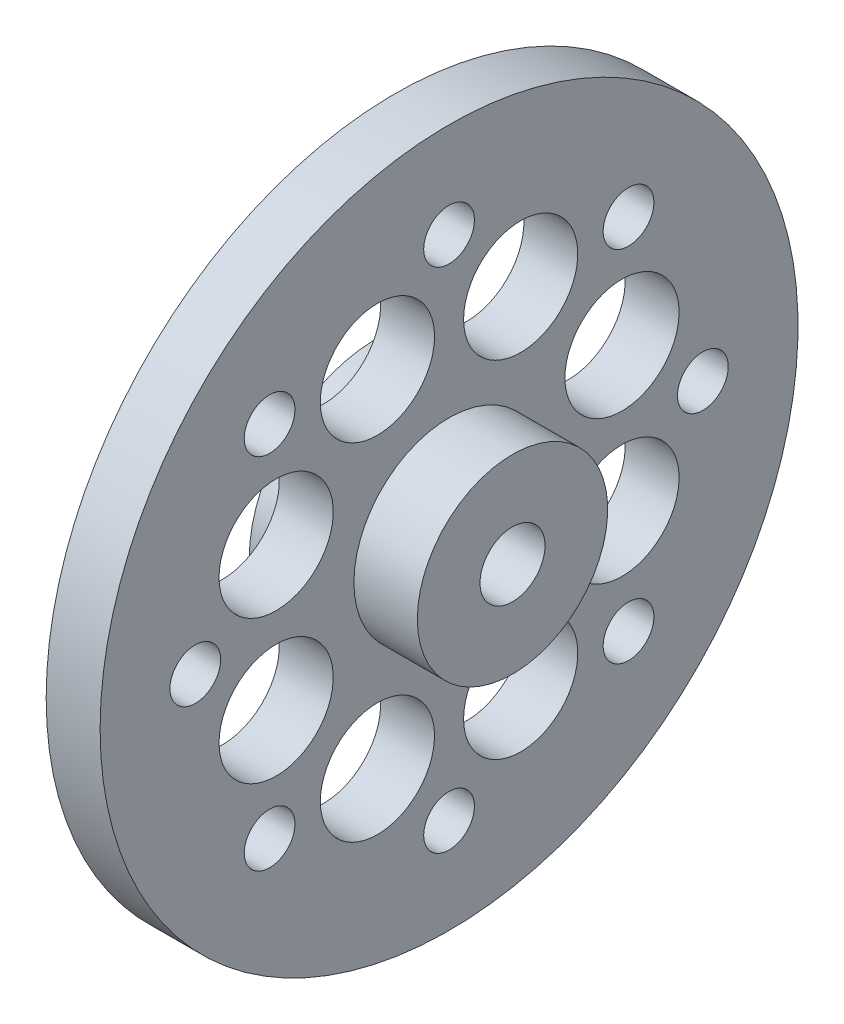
ISO-10303-21;
HEADER;
FILE_DESCRIPTION(('STEP AP214'),'2;1');
FILE_NAME('part.step','',(''),(''),'','','');
FILE_SCHEMA(('AUTOMOTIVE_DESIGN { 1 0 10303 214 1 1 1 1 }'));
ENDSEC;
DATA;
#1=APPLICATION_CONTEXT('core data for automotive mechanical design processes');
#2=APPLICATION_PROTOCOL_DEFINITION('international standard','automotive_design',2000,#1);
#3=PRODUCT_CONTEXT('',#1,'mechanical');
#4=PRODUCT('Part','Part','',(#3));
#5=PRODUCT_RELATED_PRODUCT_CATEGORY('part','',(#4));
#6=PRODUCT_DEFINITION_FORMATION('','',#4);
#7=PRODUCT_DEFINITION_CONTEXT('part definition',#1,'design');
#8=PRODUCT_DEFINITION('design','',#6,#7);
#9=PRODUCT_DEFINITION_SHAPE('','',#8);
#10=(LENGTH_UNIT() NAMED_UNIT(*) SI_UNIT(.MILLI.,.METRE.));
#11=(NAMED_UNIT(*) PLANE_ANGLE_UNIT() SI_UNIT($,.RADIAN.));
#12=(NAMED_UNIT(*) SI_UNIT($,.STERADIAN.) SOLID_ANGLE_UNIT());
#13=UNCERTAINTY_MEASURE_WITH_UNIT(LENGTH_MEASURE(1.E-05),#10,'distance_accuracy_value','');
#14=(GEOMETRIC_REPRESENTATION_CONTEXT(3) GLOBAL_UNCERTAINTY_ASSIGNED_CONTEXT((#13)) GLOBAL_UNIT_ASSIGNED_CONTEXT((#10,
#11,#12)) REPRESENTATION_CONTEXT('',''));
#15=CARTESIAN_POINT('',(0.,0.,0.));
#16=DIRECTION('',(0.,0.,1.));
#17=DIRECTION('',(1.,0.,0.));
#18=AXIS2_PLACEMENT_3D('',#15,#16,#17);
#19=CARTESIAN_POINT('',(-0.6,4.,0.));
#20=DIRECTION('',(1.,0.,0.));
#21=DIRECTION('',(0.,0.,-1.));
#22=AXIS2_PLACEMENT_3D('',#19,#20,#21);
#23=PLANE('',#22);
#24=CARTESIAN_POINT('',(-0.6,0.,0.));
#25=DIRECTION('',(-1.,0.,0.));
#26=DIRECTION('',(0.,0.,1.));
#27=AXIS2_PLACEMENT_3D('',#24,#25,#26);
#28=CIRCLE('',#27,4.);
#29=CARTESIAN_POINT('',(-0.6,0.,4.));
#30=VERTEX_POINT('',#29);
#31=EDGE_CURVE('E19',#30,#30,#28,.F.);
#32=ORIENTED_EDGE('',*,*,#31,.F.);
#33=EDGE_LOOP('',(#32));
#34=FACE_BOUND('',#33,.T.);
#35=CARTESIAN_POINT('',(-0.6,0.,0.));
#36=DIRECTION('',(1.,0.,0.));
#37=DIRECTION('',(0.,0.,-1.));
#38=AXIS2_PLACEMENT_3D('',#35,#36,#37);
#39=CIRCLE('',#38,1.02499999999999);
#40=CARTESIAN_POINT('',(-0.6,0.,-1.02499999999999));
#41=VERTEX_POINT('',#40);
#42=EDGE_CURVE('E137',#41,#41,#39,.T.);
#43=ORIENTED_EDGE('',*,*,#42,.T.);
#44=EDGE_LOOP('',(#43));
#45=FACE_BOUND('',#44,.T.);
#46=ADVANCED_FACE('F15',(#34,#45),#23,.F.);
#47=CARTESIAN_POINT('',(-0.599999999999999,0.,0.));
#48=DIRECTION('',(-1.,0.,0.));
#49=DIRECTION('',(0.,0.,1.));
#50=AXIS2_PLACEMENT_3D('',#47,#48,#49);
#51=CYLINDRICAL_SURFACE('',#50,4.);
#52=ORIENTED_EDGE('',*,*,#31,.T.);
#53=EDGE_LOOP('',(#52));
#54=FACE_BOUND('',#53,.T.);
#55=CARTESIAN_POINT('',(0.,0.,0.));
#56=DIRECTION('',(-1.,0.,0.));
#57=DIRECTION('',(0.,0.,1.));
#58=AXIS2_PLACEMENT_3D('',#55,#56,#57);
#59=CIRCLE('',#58,4.);
#60=CARTESIAN_POINT('',(0.,0.,4.));
#61=VERTEX_POINT('',#60);
#62=EDGE_CURVE('E135',#61,#61,#59,.T.);
#63=ORIENTED_EDGE('',*,*,#62,.T.);
#64=EDGE_LOOP('',(#63));
#65=FACE_BOUND('',#64,.T.);
#66=ADVANCED_FACE('F144',(#54,#65),#51,.T.);
#67=CARTESIAN_POINT('',(3.69999999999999,0.,0.));
#68=DIRECTION('',(1.,0.,0.));
#69=DIRECTION('',(0.,0.,-1.));
#70=AXIS2_PLACEMENT_3D('',#67,#68,#69);
#71=CYLINDRICAL_SURFACE('',#70,1.02499999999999);
#72=ORIENTED_EDGE('',*,*,#42,.F.);
#73=EDGE_LOOP('',(#72));
#74=FACE_BOUND('',#73,.T.);
#75=CARTESIAN_POINT('',(3.7,0.,0.));
#76=DIRECTION('',(1.,0.,0.));
#77=DIRECTION('',(0.,0.,-1.));
#78=AXIS2_PLACEMENT_3D('',#75,#76,#77);
#79=CIRCLE('',#78,1.02499999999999);
#80=CARTESIAN_POINT('',(3.7,0.,-1.02499999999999));
#81=VERTEX_POINT('',#80);
#82=EDGE_CURVE('E132',#81,#81,#79,.T.);
#83=ORIENTED_EDGE('',*,*,#82,.T.);
#84=EDGE_LOOP('',(#83));
#85=FACE_BOUND('',#84,.T.);
#86=ADVANCED_FACE('F154',(#74,#85),#71,.F.);
#87=CARTESIAN_POINT('',(0.,4.,0.));
#88=DIRECTION('',(1.,0.,0.));
#89=DIRECTION('',(0.,0.,-1.));
#90=AXIS2_PLACEMENT_3D('',#87,#88,#89);
#91=PLANE('',#90);
#92=CARTESIAN_POINT('',(0.,5.65685424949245,-5.65685424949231));
#93=DIRECTION('',(-1.,0.,0.));
#94=DIRECTION('',(0.,0.,1.));
#95=AXIS2_PLACEMENT_3D('',#92,#93,#94);
#96=CIRCLE('',#95,0.799999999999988);
#97=CARTESIAN_POINT('',(0.,5.65685424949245,-4.85685424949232));
#98=VERTEX_POINT('',#97);
#99=EDGE_CURVE('E105',#98,#98,#96,.F.);
#100=ORIENTED_EDGE('',*,*,#99,.T.);
#101=EDGE_LOOP('',(#100));
#102=FACE_BOUND('',#101,.T.);
#103=CARTESIAN_POINT('',(0.,0.,-8.));
#104=DIRECTION('',(-1.,0.,0.));
#105=DIRECTION('',(0.,0.,1.));
#106=AXIS2_PLACEMENT_3D('',#103,#104,#105);
#107=CIRCLE('',#106,0.799999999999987);
#108=CARTESIAN_POINT('',(0.,0.,-7.20000000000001));
#109=VERTEX_POINT('',#108);
#110=EDGE_CURVE('E102',#109,#109,#107,.F.);
#111=ORIENTED_EDGE('',*,*,#110,.T.);
#112=EDGE_LOOP('',(#111));
#113=FACE_BOUND('',#112,.T.);
#114=CARTESIAN_POINT('',(0.,8.,0.));
#115=DIRECTION('',(-1.,0.,0.));
#116=DIRECTION('',(0.,0.,1.));
#117=AXIS2_PLACEMENT_3D('',#114,#115,#116);
#118=CIRCLE('',#117,0.799999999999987);
#119=CARTESIAN_POINT('',(0.,8.,0.799999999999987));
#120=VERTEX_POINT('',#119);
#121=EDGE_CURVE('E84',#120,#120,#118,.F.);
#122=ORIENTED_EDGE('',*,*,#121,.T.);
#123=EDGE_LOOP('',(#122));
#124=FACE_BOUND('',#123,.T.);
#125=ORIENTED_EDGE('',*,*,#62,.F.);
#126=EDGE_LOOP('',(#125));
#127=FACE_BOUND('',#126,.T.);
#128=CARTESIAN_POINT('',(0.,0.,0.));
#129=DIRECTION('',(-1.,0.,0.));
#130=DIRECTION('',(0.,0.,1.));
#131=AXIS2_PLACEMENT_3D('',#128,#129,#130);
#132=CIRCLE('',#131,11.);
#133=CARTESIAN_POINT('',(0.,0.,11.));
#134=VERTEX_POINT('',#133);
#135=EDGE_CURVE('E81',#134,#134,#132,.F.);
#136=ORIENTED_EDGE('',*,*,#135,.F.);
#137=EDGE_LOOP('',(#136));
#138=FACE_BOUND('',#137,.T.);
#139=CARTESIAN_POINT('',(0.,5.65685424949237,5.65685424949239));
#140=DIRECTION('',(-1.,0.,0.));
#141=DIRECTION('',(0.,0.,1.));
#142=AXIS2_PLACEMENT_3D('',#139,#140,#141);
#143=CIRCLE('',#142,0.799999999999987);
#144=CARTESIAN_POINT('',(0.,5.65685424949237,6.45685424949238));
#145=VERTEX_POINT('',#144);
#146=EDGE_CURVE('E87',#145,#145,#143,.F.);
#147=ORIENTED_EDGE('',*,*,#146,.T.);
#148=EDGE_LOOP('',(#147));
#149=FACE_BOUND('',#148,.T.);
#150=CARTESIAN_POINT('',(0.,0.,8.));
#151=DIRECTION('',(-1.,0.,0.));
#152=DIRECTION('',(0.,0.,1.));
#153=AXIS2_PLACEMENT_3D('',#150,#151,#152);
#154=CIRCLE('',#153,0.799999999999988);
#155=CARTESIAN_POINT('',(0.,0.,8.79999999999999));
#156=VERTEX_POINT('',#155);
#157=EDGE_CURVE('E90',#156,#156,#154,.F.);
#158=ORIENTED_EDGE('',*,*,#157,.T.);
#159=EDGE_LOOP('',(#158));
#160=FACE_BOUND('',#159,.T.);
#161=CARTESIAN_POINT('',(0.,-5.65685424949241,5.65685424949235));
#162=DIRECTION('',(-1.,0.,0.));
#163=DIRECTION('',(0.,0.,1.));
#164=AXIS2_PLACEMENT_3D('',#161,#162,#163);
#165=CIRCLE('',#164,0.799999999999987);
#166=CARTESIAN_POINT('',(0.,-5.65685424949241,6.45685424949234));
#167=VERTEX_POINT('',#166);
#168=EDGE_CURVE('E93',#167,#167,#165,.F.);
#169=ORIENTED_EDGE('',*,*,#168,.T.);
#170=EDGE_LOOP('',(#169));
#171=FACE_BOUND('',#170,.T.);
#172=CARTESIAN_POINT('',(0.,-8.,0.));
#173=DIRECTION('',(-1.,0.,0.));
#174=DIRECTION('',(0.,0.,1.));
#175=AXIS2_PLACEMENT_3D('',#172,#173,#174);
#176=CIRCLE('',#175,0.799999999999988);
#177=CARTESIAN_POINT('',(0.,-8.,0.799999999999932));
#178=VERTEX_POINT('',#177);
#179=EDGE_CURVE('E96',#178,#178,#176,.F.);
#180=ORIENTED_EDGE('',*,*,#179,.T.);
#181=EDGE_LOOP('',(#180));
#182=FACE_BOUND('',#181,.T.);
#183=CARTESIAN_POINT('',(0.,-5.65685424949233,-5.65685424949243));
#184=DIRECTION('',(-1.,0.,0.));
#185=DIRECTION('',(0.,0.,1.));
#186=AXIS2_PLACEMENT_3D('',#183,#184,#185);
#187=CIRCLE('',#186,0.799999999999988);
#188=CARTESIAN_POINT('',(0.,-5.65685424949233,-4.85685424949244));
#189=VERTEX_POINT('',#188);
#190=EDGE_CURVE('E99',#189,#189,#187,.F.);
#191=ORIENTED_EDGE('',*,*,#190,.T.);
#192=EDGE_LOOP('',(#191));
#193=FACE_BOUND('',#192,.T.);
#194=CARTESIAN_POINT('',(0.,5.45088924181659,-2.25783225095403));
#195=DIRECTION('',(-1.,0.,0.));
#196=DIRECTION('',(0.,0.,1.));
#197=AXIS2_PLACEMENT_3D('',#194,#195,#196);
#198=CIRCLE('',#197,1.8);
#199=CARTESIAN_POINT('',(0.,5.45088924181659,-0.457832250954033));
#200=VERTEX_POINT('',#199);
#201=EDGE_CURVE('E108',#200,#200,#198,.F.);
#202=ORIENTED_EDGE('',*,*,#201,.T.);
#203=EDGE_LOOP('',(#202));
#204=FACE_BOUND('',#203,.T.);
#205=CARTESIAN_POINT('',(0.,5.45088924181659,2.25783225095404));
#206=DIRECTION('',(-1.,0.,0.));
#207=DIRECTION('',(0.,0.,1.));
#208=AXIS2_PLACEMENT_3D('',#205,#206,#207);
#209=CIRCLE('',#208,1.8);
#210=CARTESIAN_POINT('',(0.,5.45088924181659,4.05783225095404));
#211=VERTEX_POINT('',#210);
#212=EDGE_CURVE('E111',#211,#211,#209,.F.);
#213=ORIENTED_EDGE('',*,*,#212,.T.);
#214=EDGE_LOOP('',(#213));
#215=FACE_BOUND('',#214,.T.);
#216=CARTESIAN_POINT('',(0.,2.25783225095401,5.4508892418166));
#217=DIRECTION('',(-1.,0.,0.));
#218=DIRECTION('',(0.,0.,1.));
#219=AXIS2_PLACEMENT_3D('',#216,#217,#218);
#220=CIRCLE('',#219,1.8);
#221=CARTESIAN_POINT('',(0.,2.25783225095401,7.2508892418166));
#222=VERTEX_POINT('',#221);
#223=EDGE_CURVE('E114',#222,#222,#220,.F.);
#224=ORIENTED_EDGE('',*,*,#223,.T.);
#225=EDGE_LOOP('',(#224));
#226=FACE_BOUND('',#225,.T.);
#227=CARTESIAN_POINT('',(0.,-2.25783225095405,5.45088924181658));
#228=DIRECTION('',(-1.,0.,0.));
#229=DIRECTION('',(0.,0.,1.));
#230=AXIS2_PLACEMENT_3D('',#227,#228,#229);
#231=CIRCLE('',#230,1.8);
#232=CARTESIAN_POINT('',(0.,-2.25783225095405,7.25088924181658));
#233=VERTEX_POINT('',#232);
#234=EDGE_CURVE('E117',#233,#233,#231,.F.);
#235=ORIENTED_EDGE('',*,*,#234,.T.);
#236=EDGE_LOOP('',(#235));
#237=FACE_BOUND('',#236,.T.);
#238=CARTESIAN_POINT('',(0.,-5.45088924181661,2.257832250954));
#239=DIRECTION('',(-1.,0.,0.));
#240=DIRECTION('',(0.,0.,1.));
#241=AXIS2_PLACEMENT_3D('',#238,#239,#240);
#242=CIRCLE('',#241,1.8);
#243=CARTESIAN_POINT('',(0.,-5.45088924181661,4.057832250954));
#244=VERTEX_POINT('',#243);
#245=EDGE_CURVE('E120',#244,#244,#242,.F.);
#246=ORIENTED_EDGE('',*,*,#245,.T.);
#247=EDGE_LOOP('',(#246));
#248=FACE_BOUND('',#247,.T.);
#249=CARTESIAN_POINT('',(0.,-5.45088924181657,-2.25783225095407));
#250=DIRECTION('',(-1.,0.,0.));
#251=DIRECTION('',(0.,0.,1.));
#252=AXIS2_PLACEMENT_3D('',#249,#250,#251);
#253=CIRCLE('',#252,1.8);
#254=CARTESIAN_POINT('',(0.,-5.45088924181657,-0.457832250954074));
#255=VERTEX_POINT('',#254);
#256=EDGE_CURVE('E123',#255,#255,#253,.F.);
#257=ORIENTED_EDGE('',*,*,#256,.T.);
#258=EDGE_LOOP('',(#257));
#259=FACE_BOUND('',#258,.T.);
#260=CARTESIAN_POINT('',(0.,-2.25783225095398,-5.45088924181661));
#261=DIRECTION('',(-1.,0.,0.));
#262=DIRECTION('',(0.,0.,1.));
#263=AXIS2_PLACEMENT_3D('',#260,#261,#262);
#264=CIRCLE('',#263,1.8);
#265=CARTESIAN_POINT('',(0.,-2.25783225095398,-3.65088924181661));
#266=VERTEX_POINT('',#265);
#267=EDGE_CURVE('E126',#266,#266,#264,.F.);
#268=ORIENTED_EDGE('',*,*,#267,.T.);
#269=EDGE_LOOP('',(#268));
#270=FACE_BOUND('',#269,.T.);
#271=CARTESIAN_POINT('',(0.,2.25783225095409,-5.45088924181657));
#272=DIRECTION('',(-1.,0.,0.));
#273=DIRECTION('',(0.,0.,1.));
#274=AXIS2_PLACEMENT_3D('',#271,#272,#273);
#275=CIRCLE('',#274,1.8);
#276=CARTESIAN_POINT('',(0.,2.25783225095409,-3.65088924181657));
#277=VERTEX_POINT('',#276);
#278=EDGE_CURVE('E129',#277,#277,#275,.F.);
#279=ORIENTED_EDGE('',*,*,#278,.T.);
#280=EDGE_LOOP('',(#279));
#281=FACE_BOUND('',#280,.T.);
#282=ADVANCED_FACE('F207',(#102,#113,#124,#127,#138,#149,#160,#171,#182,#193,#204,#215,#226,
#237,#248,#259,#270,#281),#91,.F.);
#283=CARTESIAN_POINT('',(3.7,3.,0.));
#284=DIRECTION('',(-1.,0.,0.));
#285=DIRECTION('',(0.,0.,1.));
#286=AXIS2_PLACEMENT_3D('',#283,#284,#285);
#287=PLANE('',#286);
#288=CARTESIAN_POINT('',(3.7,0.,0.));
#289=DIRECTION('',(-1.,0.,0.));
#290=DIRECTION('',(0.,0.,1.));
#291=AXIS2_PLACEMENT_3D('',#288,#289,#290);
#292=CIRCLE('',#291,3.);
#293=CARTESIAN_POINT('',(3.7,0.,3.));
#294=VERTEX_POINT('',#293);
#295=EDGE_CURVE('E78',#294,#294,#292,.T.);
#296=ORIENTED_EDGE('',*,*,#295,.F.);
#297=EDGE_LOOP('',(#296));
#298=FACE_BOUND('',#297,.T.);
#299=ORIENTED_EDGE('',*,*,#82,.F.);
#300=EDGE_LOOP('',(#299));
#301=FACE_BOUND('',#300,.T.);
#302=ADVANCED_FACE('F203',(#298,#301),#287,.F.);
#303=CARTESIAN_POINT('',(3.7,2.25783225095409,-5.45088924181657));
#304=DIRECTION('',(-1.,0.,0.));
#305=DIRECTION('',(0.,0.,1.));
#306=AXIS2_PLACEMENT_3D('',#303,#304,#305);
#307=CYLINDRICAL_SURFACE('',#306,1.8);
#308=CARTESIAN_POINT('',(1.7,2.25783225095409,-5.45088924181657));
#309=DIRECTION('',(-1.,0.,0.));
#310=DIRECTION('',(0.,0.,1.));
#311=AXIS2_PLACEMENT_3D('',#308,#309,#310);
#312=CIRCLE('',#311,1.8);
#313=CARTESIAN_POINT('',(1.7,2.25783225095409,-3.65088924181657));
#314=VERTEX_POINT('',#313);
#315=EDGE_CURVE('E75',#314,#314,#312,.F.);
#316=ORIENTED_EDGE('',*,*,#315,.T.);
#317=EDGE_LOOP('',(#316));
#318=FACE_BOUND('',#317,.T.);
#319=ORIENTED_EDGE('',*,*,#278,.F.);
#320=EDGE_LOOP('',(#319));
#321=FACE_BOUND('',#320,.T.);
#322=ADVANCED_FACE('F199',(#318,#321),#307,.F.);
#323=CARTESIAN_POINT('',(3.7,-2.25783225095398,-5.45088924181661));
#324=DIRECTION('',(-1.,0.,0.));
#325=DIRECTION('',(0.,0.,1.));
#326=AXIS2_PLACEMENT_3D('',#323,#324,#325);
#327=CYLINDRICAL_SURFACE('',#326,1.8);
#328=CARTESIAN_POINT('',(1.7,-2.25783225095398,-5.45088924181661));
#329=DIRECTION('',(-1.,0.,0.));
#330=DIRECTION('',(0.,0.,1.));
#331=AXIS2_PLACEMENT_3D('',#328,#329,#330);
#332=CIRCLE('',#331,1.8);
#333=CARTESIAN_POINT('',(1.7,-2.25783225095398,-3.65088924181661));
#334=VERTEX_POINT('',#333);
#335=EDGE_CURVE('E72',#334,#334,#332,.F.);
#336=ORIENTED_EDGE('',*,*,#335,.T.);
#337=EDGE_LOOP('',(#336));
#338=FACE_BOUND('',#337,.T.);
#339=ORIENTED_EDGE('',*,*,#267,.F.);
#340=EDGE_LOOP('',(#339));
#341=FACE_BOUND('',#340,.T.);
#342=ADVANCED_FACE('F202',(#338,#341),#327,.F.);
#343=CARTESIAN_POINT('',(3.7,-5.45088924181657,-2.25783225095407));
#344=DIRECTION('',(-1.,0.,0.));
#345=DIRECTION('',(0.,0.,1.));
#346=AXIS2_PLACEMENT_3D('',#343,#344,#345);
#347=CYLINDRICAL_SURFACE('',#346,1.8);
#348=CARTESIAN_POINT('',(1.7,-5.45088924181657,-2.25783225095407));
#349=DIRECTION('',(-1.,0.,0.));
#350=DIRECTION('',(0.,0.,1.));
#351=AXIS2_PLACEMENT_3D('',#348,#349,#350);
#352=CIRCLE('',#351,1.8);
#353=CARTESIAN_POINT('',(1.7,-5.45088924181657,-0.457832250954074));
#354=VERTEX_POINT('',#353);
#355=EDGE_CURVE('E69',#354,#354,#352,.F.);
#356=ORIENTED_EDGE('',*,*,#355,.T.);
#357=EDGE_LOOP('',(#356));
#358=FACE_BOUND('',#357,.T.);
#359=ORIENTED_EDGE('',*,*,#256,.F.);
#360=EDGE_LOOP('',(#359));
#361=FACE_BOUND('',#360,.T.);
#362=ADVANCED_FACE('F224',(#358,#361),#347,.F.);
#363=CARTESIAN_POINT('',(3.7,-5.45088924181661,2.257832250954));
#364=DIRECTION('',(-1.,0.,0.));
#365=DIRECTION('',(0.,0.,1.));
#366=AXIS2_PLACEMENT_3D('',#363,#364,#365);
#367=CYLINDRICAL_SURFACE('',#366,1.8);
#368=CARTESIAN_POINT('',(1.7,-5.45088924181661,2.257832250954));
#369=DIRECTION('',(-1.,0.,0.));
#370=DIRECTION('',(0.,0.,1.));
#371=AXIS2_PLACEMENT_3D('',#368,#369,#370);
#372=CIRCLE('',#371,1.8);
#373=CARTESIAN_POINT('',(1.7,-5.45088924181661,4.057832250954));
#374=VERTEX_POINT('',#373);
#375=EDGE_CURVE('E66',#374,#374,#372,.F.);
#376=ORIENTED_EDGE('',*,*,#375,.T.);
#377=EDGE_LOOP('',(#376));
#378=FACE_BOUND('',#377,.T.);
#379=ORIENTED_EDGE('',*,*,#245,.F.);
#380=EDGE_LOOP('',(#379));
#381=FACE_BOUND('',#380,.T.);
#382=ADVANCED_FACE('F228',(#378,#381),#367,.F.);
#383=CARTESIAN_POINT('',(3.7,-2.25783225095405,5.45088924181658));
#384=DIRECTION('',(-1.,0.,0.));
#385=DIRECTION('',(0.,0.,1.));
#386=AXIS2_PLACEMENT_3D('',#383,#384,#385);
#387=CYLINDRICAL_SURFACE('',#386,1.8);
#388=CARTESIAN_POINT('',(1.7,-2.25783225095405,5.45088924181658));
#389=DIRECTION('',(-1.,0.,0.));
#390=DIRECTION('',(0.,0.,1.));
#391=AXIS2_PLACEMENT_3D('',#388,#389,#390);
#392=CIRCLE('',#391,1.8);
#393=CARTESIAN_POINT('',(1.7,-2.25783225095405,7.25088924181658));
#394=VERTEX_POINT('',#393);
#395=EDGE_CURVE('E63',#394,#394,#392,.F.);
#396=ORIENTED_EDGE('',*,*,#395,.T.);
#397=EDGE_LOOP('',(#396));
#398=FACE_BOUND('',#397,.T.);
#399=ORIENTED_EDGE('',*,*,#234,.F.);
#400=EDGE_LOOP('',(#399));
#401=FACE_BOUND('',#400,.T.);
#402=ADVANCED_FACE('F232',(#398,#401),#387,.F.);
#403=CARTESIAN_POINT('',(3.7,2.25783225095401,5.4508892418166));
#404=DIRECTION('',(-1.,0.,0.));
#405=DIRECTION('',(0.,0.,1.));
#406=AXIS2_PLACEMENT_3D('',#403,#404,#405);
#407=CYLINDRICAL_SURFACE('',#406,1.8);
#408=CARTESIAN_POINT('',(1.7,2.25783225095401,5.4508892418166));
#409=DIRECTION('',(-1.,0.,0.));
#410=DIRECTION('',(0.,0.,1.));
#411=AXIS2_PLACEMENT_3D('',#408,#409,#410);
#412=CIRCLE('',#411,1.8);
#413=CARTESIAN_POINT('',(1.7,2.25783225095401,7.2508892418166));
#414=VERTEX_POINT('',#413);
#415=EDGE_CURVE('E60',#414,#414,#412,.F.);
#416=ORIENTED_EDGE('',*,*,#415,.T.);
#417=EDGE_LOOP('',(#416));
#418=FACE_BOUND('',#417,.T.);
#419=ORIENTED_EDGE('',*,*,#223,.F.);
#420=EDGE_LOOP('',(#419));
#421=FACE_BOUND('',#420,.T.);
#422=ADVANCED_FACE('F236',(#418,#421),#407,.F.);
#423=CARTESIAN_POINT('',(3.7,5.45088924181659,2.25783225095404));
#424=DIRECTION('',(-1.,0.,0.));
#425=DIRECTION('',(0.,0.,1.));
#426=AXIS2_PLACEMENT_3D('',#423,#424,#425);
#427=CYLINDRICAL_SURFACE('',#426,1.8);
#428=CARTESIAN_POINT('',(1.7,5.45088924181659,2.25783225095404));
#429=DIRECTION('',(-1.,0.,0.));
#430=DIRECTION('',(0.,0.,1.));
#431=AXIS2_PLACEMENT_3D('',#428,#429,#430);
#432=CIRCLE('',#431,1.8);
#433=CARTESIAN_POINT('',(1.7,5.45088924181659,4.05783225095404));
#434=VERTEX_POINT('',#433);
#435=EDGE_CURVE('E57',#434,#434,#432,.F.);
#436=ORIENTED_EDGE('',*,*,#435,.T.);
#437=EDGE_LOOP('',(#436));
#438=FACE_BOUND('',#437,.T.);
#439=ORIENTED_EDGE('',*,*,#212,.F.);
#440=EDGE_LOOP('',(#439));
#441=FACE_BOUND('',#440,.T.);
#442=ADVANCED_FACE('F240',(#438,#441),#427,.F.);
#443=CARTESIAN_POINT('',(3.7,5.45088924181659,-2.25783225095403));
#444=DIRECTION('',(-1.,0.,0.));
#445=DIRECTION('',(0.,0.,1.));
#446=AXIS2_PLACEMENT_3D('',#443,#444,#445);
#447=CYLINDRICAL_SURFACE('',#446,1.8);
#448=CARTESIAN_POINT('',(1.7,5.45088924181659,-2.25783225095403));
#449=DIRECTION('',(-1.,0.,0.));
#450=DIRECTION('',(0.,0.,1.));
#451=AXIS2_PLACEMENT_3D('',#448,#449,#450);
#452=CIRCLE('',#451,1.8);
#453=CARTESIAN_POINT('',(1.7,5.45088924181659,-0.457832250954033));
#454=VERTEX_POINT('',#453);
#455=EDGE_CURVE('E54',#454,#454,#452,.F.);
#456=ORIENTED_EDGE('',*,*,#455,.T.);
#457=EDGE_LOOP('',(#456));
#458=FACE_BOUND('',#457,.T.);
#459=ORIENTED_EDGE('',*,*,#201,.F.);
#460=EDGE_LOOP('',(#459));
#461=FACE_BOUND('',#460,.T.);
#462=ADVANCED_FACE('F244',(#458,#461),#447,.F.);
#463=CARTESIAN_POINT('',(0.,5.65685424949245,-5.65685424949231));
#464=DIRECTION('',(-1.,0.,0.));
#465=DIRECTION('',(0.,0.,1.));
#466=AXIS2_PLACEMENT_3D('',#463,#464,#465);
#467=CYLINDRICAL_SURFACE('',#466,0.799999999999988);
#468=CARTESIAN_POINT('',(1.7,5.65685424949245,-5.65685424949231));
#469=DIRECTION('',(-1.,0.,0.));
#470=DIRECTION('',(0.,0.,1.));
#471=AXIS2_PLACEMENT_3D('',#468,#469,#470);
#472=CIRCLE('',#471,0.799999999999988);
#473=CARTESIAN_POINT('',(1.7,5.65685424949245,-4.85685424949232));
#474=VERTEX_POINT('',#473);
#475=EDGE_CURVE('E51',#474,#474,#472,.F.);
#476=ORIENTED_EDGE('',*,*,#475,.T.);
#477=EDGE_LOOP('',(#476));
#478=FACE_BOUND('',#477,.T.);
#479=ORIENTED_EDGE('',*,*,#99,.F.);
#480=EDGE_LOOP('',(#479));
#481=FACE_BOUND('',#480,.T.);
#482=ADVANCED_FACE('F248',(#478,#481),#467,.F.);
#483=CARTESIAN_POINT('',(0.,0.,-8.));
#484=DIRECTION('',(-1.,0.,0.));
#485=DIRECTION('',(0.,0.,1.));
#486=AXIS2_PLACEMENT_3D('',#483,#484,#485);
#487=CYLINDRICAL_SURFACE('',#486,0.799999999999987);
#488=CARTESIAN_POINT('',(1.7,0.,-8.));
#489=DIRECTION('',(-1.,0.,0.));
#490=DIRECTION('',(0.,0.,1.));
#491=AXIS2_PLACEMENT_3D('',#488,#489,#490);
#492=CIRCLE('',#491,0.799999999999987);
#493=CARTESIAN_POINT('',(1.7,0.,-7.20000000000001));
#494=VERTEX_POINT('',#493);
#495=EDGE_CURVE('E48',#494,#494,#492,.F.);
#496=ORIENTED_EDGE('',*,*,#495,.T.);
#497=EDGE_LOOP('',(#496));
#498=FACE_BOUND('',#497,.T.);
#499=ORIENTED_EDGE('',*,*,#110,.F.);
#500=EDGE_LOOP('',(#499));
#501=FACE_BOUND('',#500,.T.);
#502=ADVANCED_FACE('F252',(#498,#501),#487,.F.);
#503=CARTESIAN_POINT('',(0.,-5.65685424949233,-5.65685424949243));
#504=DIRECTION('',(-1.,0.,0.));
#505=DIRECTION('',(0.,0.,1.));
#506=AXIS2_PLACEMENT_3D('',#503,#504,#505);
#507=CYLINDRICAL_SURFACE('',#506,0.799999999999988);
#508=CARTESIAN_POINT('',(1.7,-5.65685424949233,-5.65685424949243));
#509=DIRECTION('',(-1.,0.,0.));
#510=DIRECTION('',(0.,0.,1.));
#511=AXIS2_PLACEMENT_3D('',#508,#509,#510);
#512=CIRCLE('',#511,0.799999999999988);
#513=CARTESIAN_POINT('',(1.7,-5.65685424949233,-4.85685424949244));
#514=VERTEX_POINT('',#513);
#515=EDGE_CURVE('E45',#514,#514,#512,.F.);
#516=ORIENTED_EDGE('',*,*,#515,.T.);
#517=EDGE_LOOP('',(#516));
#518=FACE_BOUND('',#517,.T.);
#519=ORIENTED_EDGE('',*,*,#190,.F.);
#520=EDGE_LOOP('',(#519));
#521=FACE_BOUND('',#520,.T.);
#522=ADVANCED_FACE('F256',(#518,#521),#507,.F.);
#523=CARTESIAN_POINT('',(0.,-8.,0.));
#524=DIRECTION('',(-1.,0.,0.));
#525=DIRECTION('',(0.,0.,1.));
#526=AXIS2_PLACEMENT_3D('',#523,#524,#525);
#527=CYLINDRICAL_SURFACE('',#526,0.799999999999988);
#528=CARTESIAN_POINT('',(1.7,-8.,0.));
#529=DIRECTION('',(-1.,0.,0.));
#530=DIRECTION('',(0.,0.,1.));
#531=AXIS2_PLACEMENT_3D('',#528,#529,#530);
#532=CIRCLE('',#531,0.799999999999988);
#533=CARTESIAN_POINT('',(1.7,-8.,0.799999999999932));
#534=VERTEX_POINT('',#533);
#535=EDGE_CURVE('E42',#534,#534,#532,.F.);
#536=ORIENTED_EDGE('',*,*,#535,.T.);
#537=EDGE_LOOP('',(#536));
#538=FACE_BOUND('',#537,.T.);
#539=ORIENTED_EDGE('',*,*,#179,.F.);
#540=EDGE_LOOP('',(#539));
#541=FACE_BOUND('',#540,.T.);
#542=ADVANCED_FACE('F260',(#538,#541),#527,.F.);
#543=CARTESIAN_POINT('',(0.,-5.65685424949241,5.65685424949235));
#544=DIRECTION('',(-1.,0.,0.));
#545=DIRECTION('',(0.,0.,1.));
#546=AXIS2_PLACEMENT_3D('',#543,#544,#545);
#547=CYLINDRICAL_SURFACE('',#546,0.799999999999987);
#548=CARTESIAN_POINT('',(1.7,-5.65685424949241,5.65685424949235));
#549=DIRECTION('',(-1.,0.,0.));
#550=DIRECTION('',(0.,0.,1.));
#551=AXIS2_PLACEMENT_3D('',#548,#549,#550);
#552=CIRCLE('',#551,0.799999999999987);
#553=CARTESIAN_POINT('',(1.7,-5.65685424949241,6.45685424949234));
#554=VERTEX_POINT('',#553);
#555=EDGE_CURVE('E39',#554,#554,#552,.F.);
#556=ORIENTED_EDGE('',*,*,#555,.T.);
#557=EDGE_LOOP('',(#556));
#558=FACE_BOUND('',#557,.T.);
#559=ORIENTED_EDGE('',*,*,#168,.F.);
#560=EDGE_LOOP('',(#559));
#561=FACE_BOUND('',#560,.T.);
#562=ADVANCED_FACE('F264',(#558,#561),#547,.F.);
#563=CARTESIAN_POINT('',(0.,0.,8.));
#564=DIRECTION('',(-1.,0.,0.));
#565=DIRECTION('',(0.,0.,1.));
#566=AXIS2_PLACEMENT_3D('',#563,#564,#565);
#567=CYLINDRICAL_SURFACE('',#566,0.799999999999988);
#568=CARTESIAN_POINT('',(1.7,0.,8.));
#569=DIRECTION('',(-1.,0.,0.));
#570=DIRECTION('',(0.,0.,1.));
#571=AXIS2_PLACEMENT_3D('',#568,#569,#570);
#572=CIRCLE('',#571,0.799999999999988);
#573=CARTESIAN_POINT('',(1.7,0.,8.79999999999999));
#574=VERTEX_POINT('',#573);
#575=EDGE_CURVE('E36',#574,#574,#572,.F.);
#576=ORIENTED_EDGE('',*,*,#575,.T.);
#577=EDGE_LOOP('',(#576));
#578=FACE_BOUND('',#577,.T.);
#579=ORIENTED_EDGE('',*,*,#157,.F.);
#580=EDGE_LOOP('',(#579));
#581=FACE_BOUND('',#580,.T.);
#582=ADVANCED_FACE('F268',(#578,#581),#567,.F.);
#583=CARTESIAN_POINT('',(0.,5.65685424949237,5.65685424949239));
#584=DIRECTION('',(-1.,0.,0.));
#585=DIRECTION('',(0.,0.,1.));
#586=AXIS2_PLACEMENT_3D('',#583,#584,#585);
#587=CYLINDRICAL_SURFACE('',#586,0.799999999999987);
#588=CARTESIAN_POINT('',(1.7,5.65685424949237,5.65685424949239));
#589=DIRECTION('',(-1.,0.,0.));
#590=DIRECTION('',(0.,0.,1.));
#591=AXIS2_PLACEMENT_3D('',#588,#589,#590);
#592=CIRCLE('',#591,0.799999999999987);
#593=CARTESIAN_POINT('',(1.7,5.65685424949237,6.45685424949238));
#594=VERTEX_POINT('',#593);
#595=EDGE_CURVE('E33',#594,#594,#592,.F.);
#596=ORIENTED_EDGE('',*,*,#595,.T.);
#597=EDGE_LOOP('',(#596));
#598=FACE_BOUND('',#597,.T.);
#599=ORIENTED_EDGE('',*,*,#146,.F.);
#600=EDGE_LOOP('',(#599));
#601=FACE_BOUND('',#600,.T.);
#602=ADVANCED_FACE('F272',(#598,#601),#587,.F.);
#603=CARTESIAN_POINT('',(0.,8.,0.));
#604=DIRECTION('',(-1.,0.,0.));
#605=DIRECTION('',(0.,0.,1.));
#606=AXIS2_PLACEMENT_3D('',#603,#604,#605);
#607=CYLINDRICAL_SURFACE('',#606,0.799999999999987);
#608=CARTESIAN_POINT('',(1.7,8.,0.));
#609=DIRECTION('',(-1.,0.,0.));
#610=DIRECTION('',(0.,0.,1.));
#611=AXIS2_PLACEMENT_3D('',#608,#609,#610);
#612=CIRCLE('',#611,0.799999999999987);
#613=CARTESIAN_POINT('',(1.7,8.,0.799999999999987));
#614=VERTEX_POINT('',#613);
#615=EDGE_CURVE('E28',#614,#614,#612,.F.);
#616=ORIENTED_EDGE('',*,*,#615,.T.);
#617=EDGE_LOOP('',(#616));
#618=FACE_BOUND('',#617,.T.);
#619=ORIENTED_EDGE('',*,*,#121,.F.);
#620=EDGE_LOOP('',(#619));
#621=FACE_BOUND('',#620,.T.);
#622=ADVANCED_FACE('F276',(#618,#621),#607,.F.);
#623=CARTESIAN_POINT('',(-0.599999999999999,0.,0.));
#624=DIRECTION('',(-1.,0.,0.));
#625=DIRECTION('',(0.,0.,1.));
#626=AXIS2_PLACEMENT_3D('',#623,#624,#625);
#627=CYLINDRICAL_SURFACE('',#626,11.);
#628=ORIENTED_EDGE('',*,*,#135,.T.);
#629=EDGE_LOOP('',(#628));
#630=FACE_BOUND('',#629,.T.);
#631=CARTESIAN_POINT('',(1.7,0.,0.));
#632=DIRECTION('',(-1.,0.,0.));
#633=DIRECTION('',(0.,0.,1.));
#634=AXIS2_PLACEMENT_3D('',#631,#632,#633);
#635=CIRCLE('',#634,11.);
#636=CARTESIAN_POINT('',(1.7,0.,11.));
#637=VERTEX_POINT('',#636);
#638=EDGE_CURVE('E23',#637,#637,#635,.T.);
#639=ORIENTED_EDGE('',*,*,#638,.T.);
#640=EDGE_LOOP('',(#639));
#641=FACE_BOUND('',#640,.T.);
#642=ADVANCED_FACE('F163',(#630,#641),#627,.T.);
#643=CARTESIAN_POINT('',(-0.599999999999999,0.,0.));
#644=DIRECTION('',(-1.,0.,0.));
#645=DIRECTION('',(0.,0.,1.));
#646=AXIS2_PLACEMENT_3D('',#643,#644,#645);
#647=CYLINDRICAL_SURFACE('',#646,3.);
#648=CARTESIAN_POINT('',(1.7,0.,0.));
#649=DIRECTION('',(-1.,0.,0.));
#650=DIRECTION('',(0.,0.,1.));
#651=AXIS2_PLACEMENT_3D('',#648,#649,#650);
#652=CIRCLE('',#651,3.);
#653=CARTESIAN_POINT('',(1.7,0.,3.));
#654=VERTEX_POINT('',#653);
#655=EDGE_CURVE('E10',#654,#654,#652,.F.);
#656=ORIENTED_EDGE('',*,*,#655,.T.);
#657=EDGE_LOOP('',(#656));
#658=FACE_BOUND('',#657,.T.);
#659=ORIENTED_EDGE('',*,*,#295,.T.);
#660=EDGE_LOOP('',(#659));
#661=FACE_BOUND('',#660,.T.);
#662=ADVANCED_FACE('F157',(#658,#661),#647,.T.);
#663=CARTESIAN_POINT('',(1.7,11.,0.));
#664=DIRECTION('',(-1.,0.,0.));
#665=DIRECTION('',(0.,0.,1.));
#666=AXIS2_PLACEMENT_3D('',#663,#664,#665);
#667=PLANE('',#666);
#668=ORIENTED_EDGE('',*,*,#655,.F.);
#669=EDGE_LOOP('',(#668));
#670=FACE_BOUND('',#669,.T.);
#671=ORIENTED_EDGE('',*,*,#638,.F.);
#672=EDGE_LOOP('',(#671));
#673=FACE_BOUND('',#672,.T.);
#674=ORIENTED_EDGE('',*,*,#615,.F.);
#675=EDGE_LOOP('',(#674));
#676=FACE_BOUND('',#675,.T.);
#677=ORIENTED_EDGE('',*,*,#595,.F.);
#678=EDGE_LOOP('',(#677));
#679=FACE_BOUND('',#678,.T.);
#680=ORIENTED_EDGE('',*,*,#575,.F.);
#681=EDGE_LOOP('',(#680));
#682=FACE_BOUND('',#681,.T.);
#683=ORIENTED_EDGE('',*,*,#555,.F.);
#684=EDGE_LOOP('',(#683));
#685=FACE_BOUND('',#684,.T.);
#686=ORIENTED_EDGE('',*,*,#535,.F.);
#687=EDGE_LOOP('',(#686));
#688=FACE_BOUND('',#687,.T.);
#689=ORIENTED_EDGE('',*,*,#515,.F.);
#690=EDGE_LOOP('',(#689));
#691=FACE_BOUND('',#690,.T.);
#692=ORIENTED_EDGE('',*,*,#495,.F.);
#693=EDGE_LOOP('',(#692));
#694=FACE_BOUND('',#693,.T.);
#695=ORIENTED_EDGE('',*,*,#475,.F.);
#696=EDGE_LOOP('',(#695));
#697=FACE_BOUND('',#696,.T.);
#698=ORIENTED_EDGE('',*,*,#455,.F.);
#699=EDGE_LOOP('',(#698));
#700=FACE_BOUND('',#699,.T.);
#701=ORIENTED_EDGE('',*,*,#435,.F.);
#702=EDGE_LOOP('',(#701));
#703=FACE_BOUND('',#702,.T.);
#704=ORIENTED_EDGE('',*,*,#415,.F.);
#705=EDGE_LOOP('',(#704));
#706=FACE_BOUND('',#705,.T.);
#707=ORIENTED_EDGE('',*,*,#395,.F.);
#708=EDGE_LOOP('',(#707));
#709=FACE_BOUND('',#708,.T.);
#710=ORIENTED_EDGE('',*,*,#375,.F.);
#711=EDGE_LOOP('',(#710));
#712=FACE_BOUND('',#711,.T.);
#713=ORIENTED_EDGE('',*,*,#355,.F.);
#714=EDGE_LOOP('',(#713));
#715=FACE_BOUND('',#714,.T.);
#716=ORIENTED_EDGE('',*,*,#335,.F.);
#717=EDGE_LOOP('',(#716));
#718=FACE_BOUND('',#717,.T.);
#719=ORIENTED_EDGE('',*,*,#315,.F.);
#720=EDGE_LOOP('',(#719));
#721=FACE_BOUND('',#720,.T.);
#722=ADVANCED_FACE('F17',(#670,#673,#676,#679,#682,#685,#688,#691,#694,#697,#700,#703,#706,#709,
#712,#715,#718,#721),#667,.F.);
#723=CLOSED_SHELL('',(#46,#66,#86,#282,#302,#322,#342,#362,#382,#402,#422,#442,#462,#482,#502,
#522,#542,#562,#582,#602,#622,#642,#662,#722));
#724=MANIFOLD_SOLID_BREP('B1',#723);
#725=ADVANCED_BREP_SHAPE_REPRESENTATION('',(#18,#724),#14);
#726=SHAPE_DEFINITION_REPRESENTATION(#9,#725);
ENDSEC;
END-ISO-10303-21;
